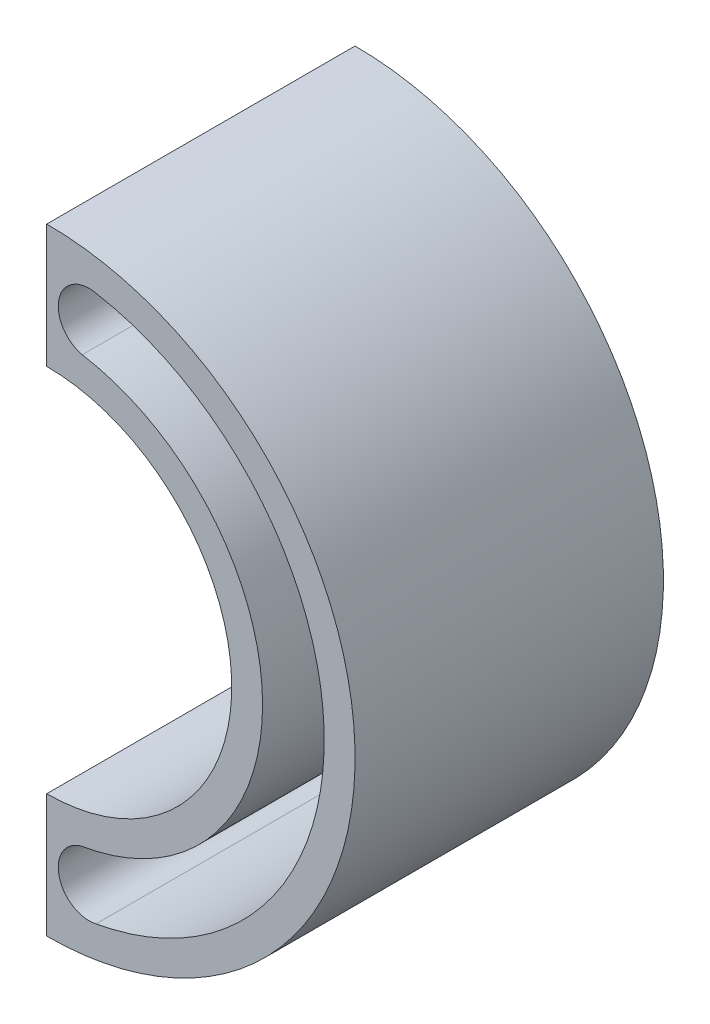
from build123d import *

# Parameters (mm, degrees)
LINEAR_AUSTRAGEN1_DEPTH         = 50
SCHNITT_LINEAR_AUSTRAGEN1_DEPTH = 50
SCHNITT_LINEAR_AUSTRAGEN2_DEPTH = 50


with BuildPart() as part:
    # Skizze1 → Linear austragen1 (new body)
    with BuildSketch(Plane.XY):
        with BuildLine():
            Line((0, 50), (0, -50))
            ThreePointArc((0, -50), (50, 0), (0, 50))
        make_face()
    extrude(amount=LINEAR_AUSTRAGEN1_DEPTH)

    # Skizze2 → Schnitt-Linear austragen1 (cut)
    with BuildSketch(Plane.XY.offset(50)):
        with BuildLine():
            ThreePointArc((0, -30), (30, 0), (0, 30))
            Line((0, 30), (0, -30))
        make_face()
    extrude(amount=-SCHNITT_LINEAR_AUSTRAGEN1_DEPTH, mode=Mode.SUBTRACT)

    # Skizze3 → Schnitt-Linear austragen2 (cut)
    with BuildSketch(Plane.XY.offset(50)):
        with BuildLine():
            ThreePointArc((8, 44.283179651), (45, 0), (8, -44.283179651))
            ThreePointArc((8, -44.283179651), (1.998585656, -40.524681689), (5.757083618, -34.523267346))
            ThreePointArc((5.757083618, -34.523267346), (35, 0), (5.757083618, 34.523267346))
            ThreePointArc((5.757083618, 34.523267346), (1.998585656, 40.524681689), (8, 44.283179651))
        make_face()
    extrude(amount=-SCHNITT_LINEAR_AUSTRAGEN2_DEPTH, mode=Mode.SUBTRACT)


solid = part.part
